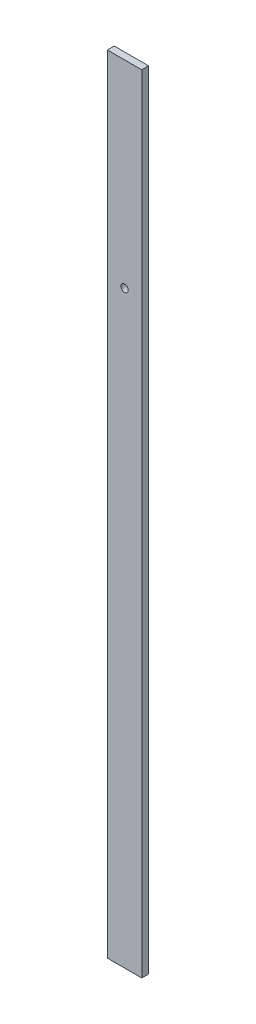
ISO-10303-21;
HEADER;
FILE_DESCRIPTION(('STEP AP214'),'2;1');
FILE_NAME('part.step','',(''),(''),'','','');
FILE_SCHEMA(('AUTOMOTIVE_DESIGN { 1 0 10303 214 1 1 1 1 }'));
ENDSEC;
DATA;
#1=APPLICATION_CONTEXT('core data for automotive mechanical design processes');
#2=APPLICATION_PROTOCOL_DEFINITION('international standard','automotive_design',2000,#1);
#3=PRODUCT_CONTEXT('',#1,'mechanical');
#4=PRODUCT('Part','Part','',(#3));
#5=PRODUCT_RELATED_PRODUCT_CATEGORY('part','',(#4));
#6=PRODUCT_DEFINITION_FORMATION('','',#4);
#7=PRODUCT_DEFINITION_CONTEXT('part definition',#1,'design');
#8=PRODUCT_DEFINITION('design','',#6,#7);
#9=PRODUCT_DEFINITION_SHAPE('','',#8);
#10=(LENGTH_UNIT() NAMED_UNIT(*) SI_UNIT(.MILLI.,.METRE.));
#11=(NAMED_UNIT(*) PLANE_ANGLE_UNIT() SI_UNIT($,.RADIAN.));
#12=(NAMED_UNIT(*) SI_UNIT($,.STERADIAN.) SOLID_ANGLE_UNIT());
#13=UNCERTAINTY_MEASURE_WITH_UNIT(LENGTH_MEASURE(1.E-05),#10,'distance_accuracy_value','');
#14=(GEOMETRIC_REPRESENTATION_CONTEXT(3) GLOBAL_UNCERTAINTY_ASSIGNED_CONTEXT((#13)) GLOBAL_UNIT_ASSIGNED_CONTEXT((#10,
#11,#12)) REPRESENTATION_CONTEXT('',''));
#15=CARTESIAN_POINT('',(0.,0.,0.));
#16=DIRECTION('',(0.,0.,1.));
#17=DIRECTION('',(1.,0.,0.));
#18=AXIS2_PLACEMENT_3D('',#15,#16,#17);
#19=CARTESIAN_POINT('',(40.,0.,-8.));
#20=DIRECTION('',(0.,0.,1.));
#21=DIRECTION('',(1.,0.,0.));
#22=AXIS2_PLACEMENT_3D('',#19,#20,#21);
#23=PLANE('',#22);
#24=CARTESIAN_POINT('',(20.,685.,-8.));
#25=DIRECTION('',(0.,0.,-1.));
#26=DIRECTION('',(-1.,0.,0.));
#27=AXIS2_PLACEMENT_3D('',#24,#25,#26);
#28=CIRCLE('',#27,4.24999999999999);
#29=CARTESIAN_POINT('',(15.75,685.,-8.));
#30=VERTEX_POINT('',#29);
#31=EDGE_CURVE('E144',#30,#30,#28,.T.);
#32=ORIENTED_EDGE('',*,*,#31,.F.);
#33=EDGE_LOOP('',(#32));
#34=FACE_BOUND('',#33,.T.);
#35=DIRECTION('',(0.,1.,0.));
#36=VECTOR('',#35,1.);
#37=CARTESIAN_POINT('',(0.,0.,-8.));
#38=LINE('',#37,#36);
#39=CARTESIAN_POINT('',(0.,0.,-8.));
#40=VERTEX_POINT('',#39);
#41=CARTESIAN_POINT('',(0.,915.,-8.));
#42=VERTEX_POINT('',#41);
#43=EDGE_CURVE('E90',#40,#42,#38,.T.);
#44=ORIENTED_EDGE('',*,*,#43,.T.);
#45=DIRECTION('',(-1.,0.,0.));
#46=VECTOR('',#45,1.);
#47=CARTESIAN_POINT('',(40.,915.,-8.));
#48=LINE('',#47,#46);
#49=CARTESIAN_POINT('',(40.,915.,-8.));
#50=VERTEX_POINT('',#49);
#51=EDGE_CURVE('E11',#50,#42,#48,.T.);
#52=ORIENTED_EDGE('',*,*,#51,.F.);
#53=DIRECTION('',(0.,1.,0.));
#54=VECTOR('',#53,1.);
#55=CARTESIAN_POINT('',(40.,0.,-8.));
#56=LINE('',#55,#54);
#57=CARTESIAN_POINT('',(40.,0.,-8.));
#58=VERTEX_POINT('',#57);
#59=EDGE_CURVE('E109',#58,#50,#56,.T.);
#60=ORIENTED_EDGE('',*,*,#59,.F.);
#61=DIRECTION('',(-1.,0.,0.));
#62=VECTOR('',#61,1.);
#63=CARTESIAN_POINT('',(40.,0.,-8.));
#64=LINE('',#63,#62);
#65=EDGE_CURVE('E53',#58,#40,#64,.T.);
#66=ORIENTED_EDGE('',*,*,#65,.T.);
#67=EDGE_LOOP('',(#44,#52,#60,#66));
#68=FACE_BOUND('',#67,.T.);
#69=ADVANCED_FACE('F38',(#34,#68),#23,.F.);
#70=CARTESIAN_POINT('',(40.,915.,0.));
#71=DIRECTION('',(0.,1.,0.));
#72=DIRECTION('',(0.,0.,1.));
#73=AXIS2_PLACEMENT_3D('',#70,#71,#72);
#74=PLANE('',#73);
#75=DIRECTION('',(0.,0.,-1.));
#76=VECTOR('',#75,1.);
#77=CARTESIAN_POINT('',(0.,915.,0.));
#78=LINE('',#77,#76);
#79=CARTESIAN_POINT('',(0.,915.,0.));
#80=VERTEX_POINT('',#79);
#81=EDGE_CURVE('E84',#80,#42,#78,.T.);
#82=ORIENTED_EDGE('',*,*,#81,.F.);
#83=DIRECTION('',(-1.,0.,0.));
#84=VECTOR('',#83,1.);
#85=CARTESIAN_POINT('',(40.,915.,0.));
#86=LINE('',#85,#84);
#87=CARTESIAN_POINT('',(40.,915.,0.));
#88=VERTEX_POINT('',#87);
#89=EDGE_CURVE('E46',#88,#80,#86,.T.);
#90=ORIENTED_EDGE('',*,*,#89,.F.);
#91=DIRECTION('',(0.,0.,-1.));
#92=VECTOR('',#91,1.);
#93=CARTESIAN_POINT('',(40.,915.,0.));
#94=LINE('',#93,#92);
#95=EDGE_CURVE('E87',#88,#50,#94,.T.);
#96=ORIENTED_EDGE('',*,*,#95,.T.);
#97=ORIENTED_EDGE('',*,*,#51,.T.);
#98=EDGE_LOOP('',(#82,#90,#96,#97));
#99=FACE_BOUND('',#98,.T.);
#100=ADVANCED_FACE('F82',(#99),#74,.T.);
#101=CARTESIAN_POINT('',(40.,0.,0.));
#102=DIRECTION('',(0.,0.,1.));
#103=DIRECTION('',(1.,0.,0.));
#104=AXIS2_PLACEMENT_3D('',#101,#102,#103);
#105=PLANE('',#104);
#106=CARTESIAN_POINT('',(20.,685.,0.));
#107=DIRECTION('',(0.,0.,-1.));
#108=DIRECTION('',(-1.,0.,0.));
#109=AXIS2_PLACEMENT_3D('',#106,#107,#108);
#110=CIRCLE('',#109,4.25);
#111=CARTESIAN_POINT('',(15.75,685.,0.));
#112=VERTEX_POINT('',#111);
#113=EDGE_CURVE('E94',#112,#112,#110,.T.);
#114=ORIENTED_EDGE('',*,*,#113,.T.);
#115=EDGE_LOOP('',(#114));
#116=FACE_BOUND('',#115,.T.);
#117=DIRECTION('',(0.,1.,0.));
#118=VECTOR('',#117,1.);
#119=CARTESIAN_POINT('',(0.,0.,0.));
#120=LINE('',#119,#118);
#121=CARTESIAN_POINT('',(0.,0.,0.));
#122=VERTEX_POINT('',#121);
#123=EDGE_CURVE('E97',#122,#80,#120,.T.);
#124=ORIENTED_EDGE('',*,*,#123,.F.);
#125=DIRECTION('',(-1.,0.,0.));
#126=VECTOR('',#125,1.);
#127=CARTESIAN_POINT('',(40.,0.,0.));
#128=LINE('',#127,#126);
#129=CARTESIAN_POINT('',(40.,0.,0.));
#130=VERTEX_POINT('',#129);
#131=EDGE_CURVE('E61',#130,#122,#128,.T.);
#132=ORIENTED_EDGE('',*,*,#131,.F.);
#133=DIRECTION('',(0.,1.,0.));
#134=VECTOR('',#133,1.);
#135=CARTESIAN_POINT('',(40.,0.,0.));
#136=LINE('',#135,#134);
#137=EDGE_CURVE('E113',#130,#88,#136,.T.);
#138=ORIENTED_EDGE('',*,*,#137,.T.);
#139=ORIENTED_EDGE('',*,*,#89,.T.);
#140=EDGE_LOOP('',(#124,#132,#138,#139));
#141=FACE_BOUND('',#140,.T.);
#142=ADVANCED_FACE('F123',(#116,#141),#105,.T.);
#143=CARTESIAN_POINT('',(40.,0.,-8.));
#144=DIRECTION('',(0.,-1.,0.));
#145=DIRECTION('',(0.,0.,-1.));
#146=AXIS2_PLACEMENT_3D('',#143,#144,#145);
#147=PLANE('',#146);
#148=DIRECTION('',(0.,0.,1.));
#149=VECTOR('',#148,1.);
#150=CARTESIAN_POINT('',(0.,0.,-8.));
#151=LINE('',#150,#149);
#152=EDGE_CURVE('E103',#40,#122,#151,.T.);
#153=ORIENTED_EDGE('',*,*,#152,.F.);
#154=ORIENTED_EDGE('',*,*,#65,.F.);
#155=DIRECTION('',(0.,0.,1.));
#156=VECTOR('',#155,1.);
#157=CARTESIAN_POINT('',(40.,0.,-8.));
#158=LINE('',#157,#156);
#159=EDGE_CURVE('E116',#58,#130,#158,.T.);
#160=ORIENTED_EDGE('',*,*,#159,.T.);
#161=ORIENTED_EDGE('',*,*,#131,.T.);
#162=EDGE_LOOP('',(#153,#154,#160,#161));
#163=FACE_BOUND('',#162,.T.);
#164=ADVANCED_FACE('F127',(#163),#147,.T.);
#165=CARTESIAN_POINT('',(40.,915.,-8.));
#166=DIRECTION('',(-1.,0.,0.));
#167=DIRECTION('',(0.,0.,1.));
#168=AXIS2_PLACEMENT_3D('',#165,#166,#167);
#169=PLANE('',#168);
#170=ORIENTED_EDGE('',*,*,#59,.T.);
#171=ORIENTED_EDGE('',*,*,#95,.F.);
#172=ORIENTED_EDGE('',*,*,#137,.F.);
#173=ORIENTED_EDGE('',*,*,#159,.F.);
#174=EDGE_LOOP('',(#170,#171,#172,#173));
#175=FACE_BOUND('',#174,.T.);
#176=ADVANCED_FACE('F125',(#175),#169,.F.);
#177=CARTESIAN_POINT('',(0.,915.,-8.));
#178=DIRECTION('',(-1.,0.,0.));
#179=DIRECTION('',(0.,0.,1.));
#180=AXIS2_PLACEMENT_3D('',#177,#178,#179);
#181=PLANE('',#180);
#182=ORIENTED_EDGE('',*,*,#43,.F.);
#183=ORIENTED_EDGE('',*,*,#152,.T.);
#184=ORIENTED_EDGE('',*,*,#123,.T.);
#185=ORIENTED_EDGE('',*,*,#81,.T.);
#186=EDGE_LOOP('',(#182,#183,#184,#185));
#187=FACE_BOUND('',#186,.T.);
#188=ADVANCED_FACE('F96',(#187),#181,.T.);
#189=CARTESIAN_POINT('',(20.,685.,-8.));
#190=DIRECTION('',(0.,0.,-1.));
#191=DIRECTION('',(-1.,0.,0.));
#192=AXIS2_PLACEMENT_3D('',#189,#190,#191);
#193=CYLINDRICAL_SURFACE('',#192,4.24999999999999);
#194=ORIENTED_EDGE('',*,*,#113,.F.);
#195=EDGE_LOOP('',(#194));
#196=FACE_BOUND('',#195,.T.);
#197=ORIENTED_EDGE('',*,*,#31,.T.);
#198=EDGE_LOOP('',(#197));
#199=FACE_BOUND('',#198,.T.);
#200=ADVANCED_FACE('F151',(#196,#199),#193,.F.);
#201=CLOSED_SHELL('',(#69,#100,#142,#164,#176,#188,#200));
#202=MANIFOLD_SOLID_BREP('B2',#201);
#203=ADVANCED_BREP_SHAPE_REPRESENTATION('',(#18,#202),#14);
#204=SHAPE_DEFINITION_REPRESENTATION(#9,#203);
ENDSEC;
END-ISO-10303-21;
